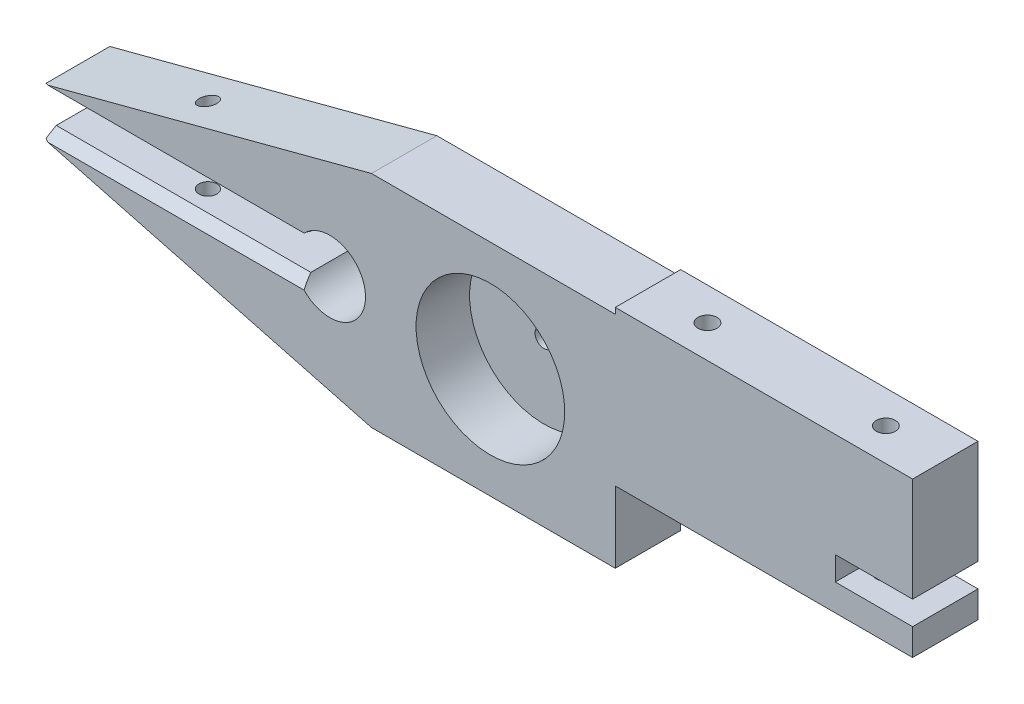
from build123d import *
from OCP.BRepFilletAPI import BRepFilletAPI_MakeChamfer

# Parameters (mm, degrees)
EXTRUDE1_DEPTH          = 5.5
CUT_EXTRUDE1_DEPTH      = 88.381348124
CUT_EXTRUDE1_DEPTH_BACK = 88.381348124
SKETCH2_R               = 1.6
SKETCH2_R_2             = 1.5
CHAMFER1_SIZE           = 2
CHAMFER1_SIZE2          = 1.154700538


with BuildPart() as part:
    # Sketch1 → Extrude1 (new, symmetric)
    with BuildSketch(Plane.XY):
        with BuildLine():
            Line((61, -2), (61, -6.5))
            Line((61, -6.5), (11, -6.5))
            Line((11, -6.5), (11, -18.5))
            Line((11, -18.5), (-30, -18.5))
            Line((-30, -18.5), (-85, -4))
            Line((-85, -4), (-85, -3))
            Line((-85, -3), (-42.196152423, -3))
            ThreePointArc((-42.196152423, -3), (-31, 0), (-42.196152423, 3))
            Line((-42.196152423, 3), (-85, 3))
            Line((-85, 3), (-85, 4))
            Line((-85, 4), (-30, 18.5))
            Line((-30, 18.5), (11, 18.5))
            Line((11, 18.5), (11, 19.5))
            Line((11, 19.5), (61, 19.5))
            Line((61, 19.5), (61, 2))
            Line((61, 2), (48, 2))
            Line((48, 2), (48, -2))
            Line((48, -2), (61, -2))
        make_face()
    extrude(amount=EXTRUDE1_DEPTH, both=True)

    # Sketch2 → Cut-Extrude1 (cut, two sides: drawn at the far end of the back side and taken through both)
    with BuildSketch(Plane(origin=(0, 0, 0), x_dir=(1, 0, 0), z_dir=(0, 1, 0)).offset(-CUT_EXTRUDE1_DEPTH_BACK)):
        with Locations(Location((21, 0, 0), (0, 0, 270))):
            Circle(SKETCH2_R)
        with Locations(Location((51, 0, 0), (0, 0, 270))):
            Circle(SKETCH2_R)
        with Locations((-63, 0)):
            Circle(SKETCH2_R_2)
    extrude(amount=CUT_EXTRUDE1_DEPTH + CUT_EXTRUDE1_DEPTH_BACK, mode=Mode.SUBTRACT)

    # Chamfer1: one chamfer whose edges measure the first distance from different faces: ONE call of the kernel's chamfer builder (chamfer() names one face for all edges)
    chamfer1_edges_1 = [part.edges().sort_by_distance(p)[0] for p in [
        (-63.598076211, -3, 5.5),
    ]]
    chamfer1_side_1 = [part.faces().sort_by_distance(p)[0] for p in [
        (-63.598076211, -3, -5.058053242),
    ]]
    chamfer1_edges_2 = [part.edges().sort_by_distance(p)[0] for p in [
        (-63.598076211, 3, 5.5),
    ]]
    chamfer1_side_2 = [part.faces().sort_by_distance(p)[0] for p in [
        (-63.598076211, 3, -5.058053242),
    ]]
    chamfer1 = BRepFilletAPI_MakeChamfer(part.part.solid().wrapped)
    for e in chamfer1_edges_1:
        chamfer1.Add(CHAMFER1_SIZE, CHAMFER1_SIZE2, e.wrapped, chamfer1_side_1[0].wrapped)  # the first distance lies on this face
    for e in chamfer1_edges_2:
        chamfer1.Add(CHAMFER1_SIZE, CHAMFER1_SIZE2, e.wrapped, chamfer1_side_2[0].wrapped)  # the first distance lies on this face
    add(Compound.cast(chamfer1.Shape()), mode=Mode.REPLACE)

    # Sketch3 → Cut-Revolve1 (revolve, cut)
    with BuildSketch(Plane(origin=(0, 0, 0), x_dir=(1, 0, 0), z_dir=(0, 1, 0))):
        Polygon((-10, 5.5), (-8.5, 5.5), (-8.5, 3.5), (2.5, 3.5), (2.5, -5.5), (-10, -5.5), align=None)
    revolve(axis=Axis((-10, 0, -5.5), (0, 0, -1)), mode=Mode.SUBTRACT)


solid = part.part
